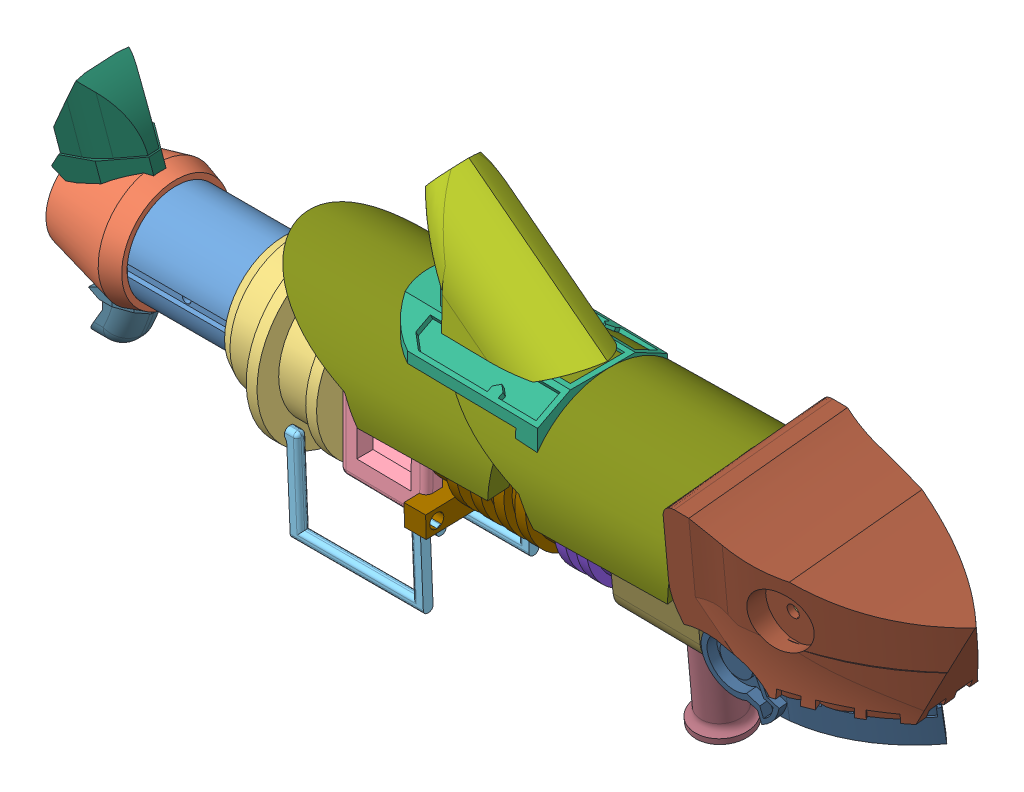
SolidWorks assembly Fishbones.SLDASM, configuration Default (file format 14000). Lengths in mm.
Overall size (1088.25 479.09 243.4).
20 component instances, 16 part files, 20 mates.
Components (placement in the parent):
- Ankle_V1-1: Ankle_V1.SLDPRT [Default] at (46.0133 129.8275 71.7944) size (139.7 114.3 113.59)
- Thurster_V1-1: Thurster_V1.SLDPRT [Default] at (-10.6962 100.8089 71.7944) x (0 -0.997435 0.071579) z (0 -0.071579 -0.997435) size (139.7 101.6 139.7)
- CoreHolder-1: CoreHolder.SLDPRT [Default] at (116.3038 100.8089 71.7944) x (1 0 0) z (0 -0.003664 0.999993) size (127 203.2 203.2)
- SensorStation-1: SensorStation.SLDPRT [Default] at (243.3038 23.9739 7.0546) x (0.999897 -0.014357 0) z (0 0 1) size (103.44 135.89 137.16)
- Handle-1: Handle.SLDPRT [Default] at (168.3738 33.5534 128.5062) x (1 0 0) z (0 -0.042413 0.9991) size (194.31 114.3 11.43)
- Handle-2: Handle.SLDPRT [Default] at (170.9138 32.4749 2.9868) size (194.31 114.3 11.43)
- TopFinHolder-1: TopFinHolder.SLDPRT [Default] at (499.6008 197.1843 5.4566) x (0 0 1) z (-0.999863 0.01655 0) size (152.4 58.42 203.2) (hidden)
- TopFinn-1: TopFinn.SLDPRT [Default] at (469.6504 229.4344 37.2066) x (0.999863 -0.01655 0) z (0 0 1) size (195.8 154.69 106.14)
- HalfRibCage-1: HalfRibCage.SLDPRT [Default] at (560.8038 103.3851 77.3378) x (0 0.998558 0.053689) z (-1 0 0) size (133.35 133.35 71.12)
- NewRibCage-1: NewRibCage.SLDPRT [Default] at (489.6838 103.3851 77.3378) x (0 -0.027517 0.999621) z (-1 0 0) size (152.4 154.15 152.4)
- SharkHead-1: SharkHead.SLDASM [Default] at (782.4163 65.3949 33.5231) x (0 0.104423 -0.994533) z (0.998614 0.052353 0.005497) size (197.12 333.24 395.88)
  - SharkHeadTop-1: SharkHeadTop.SLDPRT [Default] at (-120.0766 -26.8589 -48.1411) size (133.35 86.78 216.5)
  - SharkHeadBottom-1: SharkHeadBottom.SLDPRT [Default] at (43.0915 86.9145 -62.5556) x (-1 0 0) z (0 -0.066973 0.997755) size (197.12 159.68 270.98)
  - GripAssembly-1: GripAssembly.SLDASM [Default] at (129.7669 -76.1094 -296.1543) x (0 -0.066973 0.997755) z (-1 0 0) size (154.41 264.16 127)
    - HandleStation-1: HandleStation.SLDPRT [Default] at (69.1142 70.8775 99.6541) size (154.41 139.7 127)
    - Grip-1: Grip.SLDPRT [Default] at (120.4898 -47.2325 163.1935) x (1 0 0) z (0 1 0) size (63.5 63.5 133.35)
- BottomFin-1: BottomFin.SLDPRT [Default] at (-69.1909 42.2319 48.3945) size (68.35 63.5 60.2)
- FishBack-1: FishBack.SLDPRT [Default] at (-97.9005 145.588 33.8428) x (-0.028344 -0.086342 0.995862) z (-0.241326 0.967384 0.077005) size (84.99 89.72 101.6)
- NewShield-1: NewShield.SLDPRT [Default] at (359.4953 124.5712 179.973) x (-0.030796 0.154511 -0.987511) z (0.999271 -0.017553 -0.033909) size (203.69 92.1 304.8)
- NewShield-2: NewShield.SLDPRT [Default] at (153.3418 119.5799 175.5705) x (-0.003354 0.066291 -0.997795) z (0.999897 0.014171 -0.00242) size (203.69 92.1 304.8)
Mates (geometry in assembly coordinates):
- Concentric1: concentric anti-aligned: cone of Ankle_V1-1 through (-10.6962 100.8089 71.7944) axis (-1 0 0); cone of Thurster_V1-1 through (-10.6962 100.8089 71.7944) axis (1 0 0)
- Coincident3: coincident anti-aligned: plane of Ankle_V1-1 through (-17.0462 100.8089 71.7944) normal (-1 0 0); plane of Thurster_V1-1 through (-17.0462 100.8089 71.7944) normal (1 0 0)
- Concentric3: concentric anti-aligned: circle of Ankle_V1-1; circle of CoreHolder-1
- Coincident9: coincident anti-aligned: circle of Ankle_V1-1; plane of CoreHolder-1 through (116.3038 100.8089 71.7944) normal (-1 0 0)
- Coincident10: coincident anti-aligned: plane of CoreHolder-1 through (243.3038 189.7083 72.1201) normal (1 0 0); plane of SensorStation-1 through (243.3038 176.3896 134.0546) normal (-1 0 0)
- Tangent9: tangent anti-aligned: plane of SensorStation-1 through (370.3038 43.0239 26.1046) normal (0 1 0); cylinder of CoreHolder-1 through (256.0038 100.8089 71.7944) axis (-1 0 0) radius 57.785
- Parallel3: parallel aligned: plane of Ankle_V1-1 through (-29.7462 107.1589 20.9944) normal (0 0 -1); plane of SensorStation-1 through (243.3038 23.9739 7.0546) normal (0 0 -1)
- Parallel4: parallel aligned: plane of Thurster_V1-1 through (-10.6962 37.4717 76.3397) normal (1 0 0); plane of CoreHolder-1 through (186.1538 202.4082 72.1667) normal (1 0 0)
- Concentric17: concentric aligned: cylinder of CoreHolder-1 through (109.9538 38.3595 135.066) axis (1 0 0) radius 6.35; cylinder of Handle-1 through (168.3738 38.3595 135.066) axis (1 0 0) radius 5.08
- Distance3: distance = 5.08 mm aligned: plane of CoreHolder-1 through (173.4538 177.0083 72.0736) normal (-1 0 0); plane of Handle-1 through (168.3738 33.0687 139.9259) normal (-1 0 0)
- Concentric20: concentric aligned: cylinder of Ankle_V1-1 through (122.6538 100.8089 71.7944) axis (1 0 0) radius 57.15; cylinder of CoreHolder-1 through (243.3038 100.8089 71.7944) axis (1 0 0) radius 76.2
- Concentric21: concentric aligned: cylinder of CoreHolder-1 through (109.9538 38.8249 8.0668) axis (1 0 0) radius 6.35; cylinder of Handle-2 through (170.9138 38.8249 8.0668) axis (1 0 0) radius 5.08
- Distance4: distance = 2.54 mm aligned: plane of CoreHolder-1 through (173.4538 177.0083 72.0736) normal (-1 0 0); plane of Handle-2 through (170.9138 32.4749 14.4168) normal (-1 0 0)
- Concentric22: concentric aligned: cylinder of TopFinHolder-1 through (380.5734 219.4773 81.6566) axis (0.01655 0.999863 0) radius 6.35; cylinder of TopFinn-1 through (380.5734 219.4773 81.6566) axis (0.01655 0.999863 0) radius 6.35
- Coincident25: coincident aligned: plane of TopFinHolder-1 through (296.7649 220.8646 119.7566) normal (-0.01655 -0.999863 0); plane of TopFinn-1 through (399.6208 219.1621 81.6566) normal (-0.01655 -0.999863 0)
- Concentric23: concentric aligned: cylinder of TopFinHolder-1 through (437.7156 218.5315 81.6566) axis (0.01655 0.999863 0) radius 6.35; cylinder of TopFinn-1 through (437.7156 218.5315 81.6566) axis (0.01655 0.999863 0) radius 6.35
- Coincident26: coincident anti-aligned: plane of HalfRibCage-1 through (489.6838 -23.4647 146.8276) normal (-1 0 0); plane of NewRibCage-1 through (489.6838 103.3851 77.3378) normal (1 0 0)
- Concentric24: concentric aligned: circle of HalfRibCage-1; circle of NewRibCage-1
- Coincident28: coincident aligned: plane of Handle-1 through (362.6838 31.7998 139.8721) normal (1 0 0); plane of NewRibCage-1 through (362.6838 103.3851 77.3378) normal (1 0 0)
- Coincident29: coincident anti-aligned: plane of HalfRibCage-1 through (560.8038 103.3851 77.3378) normal (1 0 0); plane of SharkHead-1/GripAssembly-1/HandleStation-1 through (560.8038 185.263 143.5287) normal (-1 0 0)
